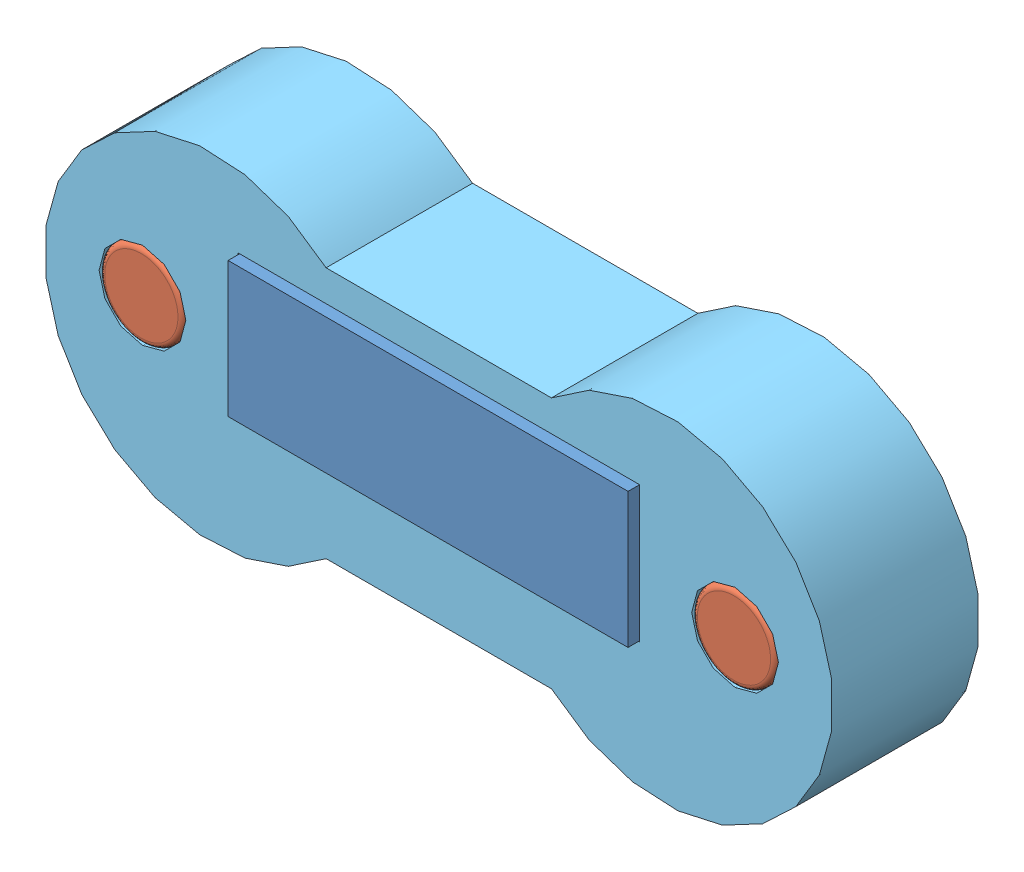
SolidWorks assembly Manette.SLDASM, configuration Défaut (file format 6000). Lengths in mm.
Overall size (140 60 28).
7 component instances, 5 part files, 13 mates.
Components (placement in the parent):
- Afficheur-1: Afficheur.SLDPRT [Défaut] at (83.2917 -25.9497 67.2514) size (84 44 13)
- Bouton-1: Bouton.SLDPRT [Défaut] at (68.3917 -5.1997 72.4514) x (1 0 0) z (0 -1 0) size (17 14.5 17)
- CIbouton-1: CIbouton.SLDPRT [Défaut] at (173.5917 -0.1997 58.2514) size (24 20 16.36)
- Base-2: Base.SLDPRT [Défaut] at (50.9917 -36.8997 52.2514) size (137 57 6)
- CIbouton-2: CIbouton.SLDPRT [Défaut] at (68.3917 -0.1997 58.2514) size (24 20 16.36)
- Bouton-2: Bouton.SLDPRT [Défaut] at (173.5917 -5.1997 72.4514) x (1 0 0) z (0 -1 0) size (17 14.5 17)
- Coque-2: Coque.SLDPRT [Défaut] at (50.9917 -36.8997 52.2514) size (140 60 26)
Mates (geometry in assembly coordinates):
- Coïncidente11: coincident anti-aligned: plane of CIbouton-1 through (163.5917 -0.1997 58.2514) normal (0 0 -1); plane of Base-2 through (80.9917 -7.039 58.2514) normal (0 0 1)
- Coïncidente12: coincident anti-aligned: plane of Base-2 through (80.9917 -7.039 58.2514) normal (0 0 1); plane of CIbouton-2 through (58.3917 -0.1997 58.2514) normal (0 0 -1)
- Coaxiale8: concentric anti-aligned: cylinder of CIbouton-1 through (173.5917 -5.1997 63.9514) axis (0 0 -1) radius 1.75; cylinder of Bouton-2 through (173.5917 -5.1997 135.8332) axis (0 0 1) radius 2.5
- Coïncidente13: coincident anti-aligned: plane of CIbouton-1 through (173.5917 -5.1997 63.9514) normal (0 0 1); plane of Bouton-2 through (171.0917 -5.1997 63.9514) normal (0 0 -1)
- Coïncidente14: coincident anti-aligned: plane of Bouton-1 through (65.8917 -5.1997 63.9514) normal (0 0 -1); plane of CIbouton-2 through (68.3917 -5.1997 63.9514) normal (0 0 1)
- Coaxiale11: concentric anti-aligned: cylinder of Bouton-1 through (68.3917 -5.1997 135.8332) axis (0 0 1) radius 2.5; cylinder of CIbouton-2 through (68.3917 -5.1997 63.9514) axis (0 0 -1) radius 1.75
- Coaxiale15: concentric aligned: cylinder of Base-2 through (80.9917 -7.039 58.2514) axis (0 0 -1) radius 28.5; cylinder of Coque-2 through (80.9917 -7.039 77.2514) axis (0 0 -1) radius 30
- Coaxiale16: concentric aligned: cylinder of Bouton-1 through (68.3917 -5.1997 135.8332) axis (0 0 1) radius 7.5; cylinder of Coque-2 through (68.3917 -5.1997 52.2514) axis (0 0 1) radius 7.7
- Coaxiale17: concentric aligned: cylinder of Bouton-2 through (173.5917 -5.1997 135.8332) axis (0 0 1) radius 7.5; cylinder of Coque-2 through (173.5917 -5.1997 52.2514) axis (0 0 1) radius 7.7
- Coaxiale18: concentric aligned: cylinder of Base-2 through (80.9917 -7.039 58.2514) axis (0 0 -1) radius 28.5; cylinder of Coque-2 through (80.9917 -7.039 77.2514) axis (0 0 -1) radius 29
- Distance1: distance = 0.05 mm anti-aligned: plane of Coque-2 through (85.3917 9.8003 52.2514) normal (0 -1 0); plane of Afficheur-1 through (85.5917 9.7503 80.2514) normal (0 1 0)
- Coïncidente16: coincident anti-aligned: plane of Afficheur-1 through (156.5917 9.7503 80.2514) normal (1 0 0); plane of Coque-2 through (156.5917 9.8003 52.2514) normal (-1 0 0)
- Coïncidente17: coincident aligned: plane of Base-2 through (80.9917 -7.039 52.2514) normal (0 0 -1); plane of Coque-2 through (80.9917 -7.039 52.2514) normal (0 0 -1)
